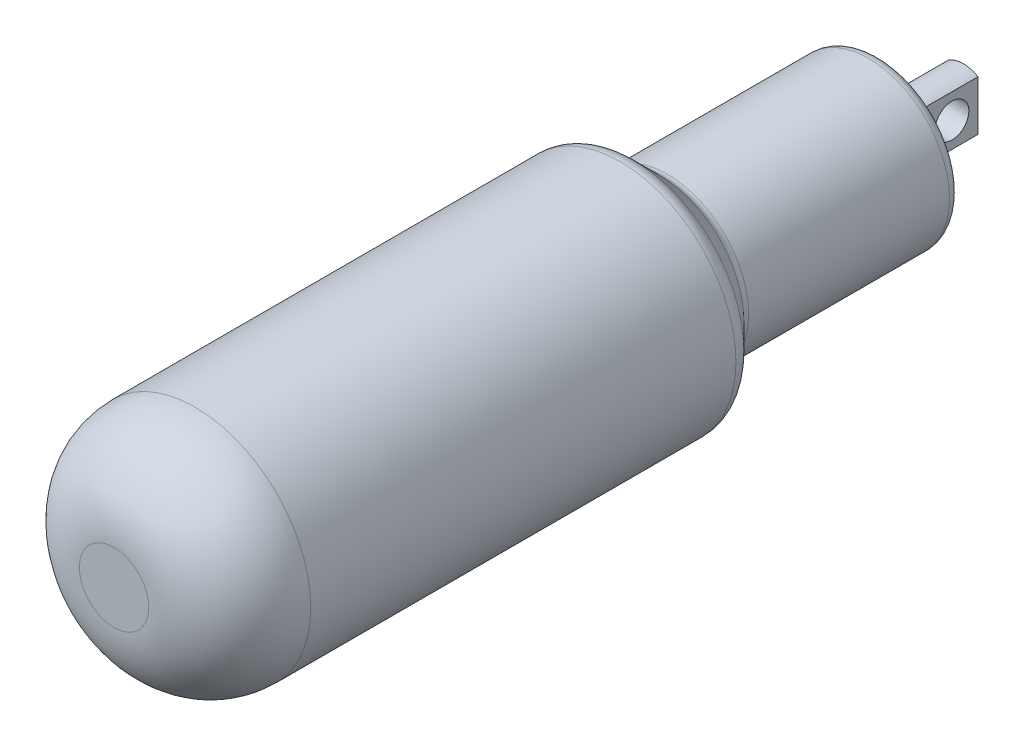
ISO-10303-21;
HEADER;
FILE_DESCRIPTION(('STEP AP214'),'2;1');
FILE_NAME('part.step','',(''),(''),'','','');
FILE_SCHEMA(('AUTOMOTIVE_DESIGN { 1 0 10303 214 1 1 1 1 }'));
ENDSEC;
DATA;
#1=APPLICATION_CONTEXT('core data for automotive mechanical design processes');
#2=APPLICATION_PROTOCOL_DEFINITION('international standard','automotive_design',2000,#1);
#3=PRODUCT_CONTEXT('',#1,'mechanical');
#4=PRODUCT('Part','Part','',(#3));
#5=PRODUCT_RELATED_PRODUCT_CATEGORY('part','',(#4));
#6=PRODUCT_DEFINITION_FORMATION('','',#4);
#7=PRODUCT_DEFINITION_CONTEXT('part definition',#1,'design');
#8=PRODUCT_DEFINITION('design','',#6,#7);
#9=PRODUCT_DEFINITION_SHAPE('','',#8);
#10=(LENGTH_UNIT() NAMED_UNIT(*) SI_UNIT(.MILLI.,.METRE.));
#11=(NAMED_UNIT(*) PLANE_ANGLE_UNIT() SI_UNIT($,.RADIAN.));
#12=(NAMED_UNIT(*) SI_UNIT($,.STERADIAN.) SOLID_ANGLE_UNIT());
#13=UNCERTAINTY_MEASURE_WITH_UNIT(LENGTH_MEASURE(1.E-05),#10,'distance_accuracy_value','');
#14=(GEOMETRIC_REPRESENTATION_CONTEXT(3) GLOBAL_UNCERTAINTY_ASSIGNED_CONTEXT((#13)) GLOBAL_UNIT_ASSIGNED_CONTEXT((#10,
#11,#12)) REPRESENTATION_CONTEXT('',''));
#15=CARTESIAN_POINT('',(0.,0.,0.));
#16=DIRECTION('',(0.,0.,1.));
#17=DIRECTION('',(1.,0.,0.));
#18=AXIS2_PLACEMENT_3D('',#15,#16,#17);
#19=CARTESIAN_POINT('',(0.,0.,-2.6999946));
#20=DIRECTION('',(0.,0.,1.));
#21=DIRECTION('',(1.,0.,0.));
#22=AXIS2_PLACEMENT_3D('',#19,#20,#21);
#23=CYLINDRICAL_SURFACE('',#22,2.99999997);
#24=CARTESIAN_POINT('',(0.,0.,5.9400054));
#25=DIRECTION('',(0.,0.,1.));
#26=DIRECTION('',(1.,0.,0.));
#27=AXIS2_PLACEMENT_3D('',#24,#25,#26);
#28=CIRCLE('',#27,2.99999997);
#29=CARTESIAN_POINT('',(2.99999997,0.,5.9400054));
#30=VERTEX_POINT('',#29);
#31=EDGE_CURVE('E99',#30,#30,#28,.T.);
#32=ORIENTED_EDGE('',*,*,#31,.F.);
#33=EDGE_LOOP('',(#32));
#34=FACE_BOUND('',#33,.T.);
#35=DIRECTION('',(0.,0.,1.));
#36=VECTOR('',#35,1.);
#37=CARTESIAN_POINT('',(-1.51574815,-2.5889201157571,-2.6999946));
#38=LINE('',#37,#36);
#39=CARTESIAN_POINT('',(-1.51574815,-2.5889201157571,-2.6999946));
#40=VERTEX_POINT('',#39);
#41=CARTESIAN_POINT('',(-1.51574815,-2.5889201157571,2.700003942));
#42=VERTEX_POINT('',#41);
#43=EDGE_CURVE('E105',#40,#42,#38,.T.);
#44=ORIENTED_EDGE('',*,*,#43,.F.);
#45=CARTESIAN_POINT('',(0.,0.,-2.6999946));
#46=DIRECTION('',(0.,0.,1.));
#47=DIRECTION('',(1.,0.,0.));
#48=AXIS2_PLACEMENT_3D('',#45,#46,#47);
#49=CIRCLE('',#48,2.99999997);
#50=CARTESIAN_POINT('',(1.51574815,-2.5889201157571,-2.6999946));
#51=VERTEX_POINT('',#50);
#52=EDGE_CURVE('E104',#40,#51,#49,.T.);
#53=ORIENTED_EDGE('',*,*,#52,.T.);
#54=DIRECTION('',(0.,0.,1.));
#55=VECTOR('',#54,1.);
#56=CARTESIAN_POINT('',(1.51574815,-2.5889201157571,-2.6999946));
#57=LINE('',#56,#55);
#58=CARTESIAN_POINT('',(1.51574815,-2.5889201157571,2.700003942));
#59=VERTEX_POINT('',#58);
#60=EDGE_CURVE('E29',#59,#51,#57,.F.);
#61=ORIENTED_EDGE('',*,*,#60,.F.);
#62=CARTESIAN_POINT('',(0.,0.,2.700003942));
#63=DIRECTION('',(0.,0.,-1.));
#64=DIRECTION('',(-1.,0.,0.));
#65=AXIS2_PLACEMENT_3D('',#62,#63,#64);
#66=CIRCLE('',#65,2.99999997);
#67=CARTESIAN_POINT('',(1.51574815,2.58892011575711,2.700003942));
#68=VERTEX_POINT('',#67);
#69=EDGE_CURVE('E22',#68,#59,#66,.T.);
#70=ORIENTED_EDGE('',*,*,#69,.F.);
#71=DIRECTION('',(0.,0.,1.));
#72=VECTOR('',#71,1.);
#73=CARTESIAN_POINT('',(1.51574815,2.58892011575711,-2.6999946));
#74=LINE('',#73,#72);
#75=CARTESIAN_POINT('',(1.51574815,2.58892011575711,-2.6999946));
#76=VERTEX_POINT('',#75);
#77=EDGE_CURVE('E54',#76,#68,#74,.T.);
#78=ORIENTED_EDGE('',*,*,#77,.F.);
#79=CARTESIAN_POINT('',(-1.51574815,2.58892011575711,-2.6999946));
#80=VERTEX_POINT('',#79);
#81=EDGE_CURVE('E102',#76,#80,#49,.T.);
#82=ORIENTED_EDGE('',*,*,#81,.T.);
#83=DIRECTION('',(0.,0.,1.));
#84=VECTOR('',#83,1.);
#85=CARTESIAN_POINT('',(-1.51574815,2.58892011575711,-2.6999946));
#86=LINE('',#85,#84);
#87=CARTESIAN_POINT('',(-1.51574815,2.58892011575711,2.700003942));
#88=VERTEX_POINT('',#87);
#89=EDGE_CURVE('E37',#88,#80,#86,.F.);
#90=ORIENTED_EDGE('',*,*,#89,.F.);
#91=CARTESIAN_POINT('',(0.,0.,2.700003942));
#92=DIRECTION('',(0.,0.,-1.));
#93=DIRECTION('',(-1.,0.,0.));
#94=AXIS2_PLACEMENT_3D('',#91,#92,#93);
#95=CIRCLE('',#94,2.99999997);
#96=EDGE_CURVE('E9',#42,#88,#95,.T.);
#97=ORIENTED_EDGE('',*,*,#96,.F.);
#98=EDGE_LOOP('',(#44,#53,#61,#70,#78,#82,#90,#97));
#99=FACE_BOUND('',#98,.T.);
#100=ADVANCED_FACE('F14',(#34,#99),#23,.T.);
#101=CARTESIAN_POINT('',(0.,2.99999997,-2.6999946));
#102=DIRECTION('',(0.,0.,1.));
#103=DIRECTION('',(1.,0.,0.));
#104=AXIS2_PLACEMENT_3D('',#101,#102,#103);
#105=PLANE('',#104);
#106=DIRECTION('',(0.,-1.,0.));
#107=VECTOR('',#106,1.);
#108=CARTESIAN_POINT('',(-1.51574815,2.99999997,-2.6999946));
#109=LINE('',#108,#107);
#110=EDGE_CURVE('E71',#80,#40,#109,.T.);
#111=ORIENTED_EDGE('',*,*,#110,.F.);
#112=ORIENTED_EDGE('',*,*,#81,.F.);
#113=DIRECTION('',(0.,1.,0.));
#114=VECTOR('',#113,1.);
#115=CARTESIAN_POINT('',(1.51574815,2.99999997,-2.6999946));
#116=LINE('',#115,#114);
#117=EDGE_CURVE('E58',#51,#76,#116,.T.);
#118=ORIENTED_EDGE('',*,*,#117,.F.);
#119=ORIENTED_EDGE('',*,*,#52,.F.);
#120=EDGE_LOOP('',(#111,#112,#118,#119));
#121=FACE_BOUND('',#120,.T.);
#122=ADVANCED_FACE('F127',(#121),#105,.F.);
#123=CARTESIAN_POINT('',(0.,0.,85.400002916));
#124=DIRECTION('',(0.,0.,-1.));
#125=DIRECTION('',(-1.,0.,0.));
#126=AXIS2_PLACEMENT_3D('',#123,#124,#125);
#127=PLANE('',#126);
#128=CARTESIAN_POINT('',(0.,0.,85.400002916));
#129=DIRECTION('',(0.,0.,1.));
#130=DIRECTION('',(1.,0.,0.));
#131=AXIS2_PLACEMENT_3D('',#128,#129,#130);
#132=CIRCLE('',#131,3.600000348);
#133=CARTESIAN_POINT('',(3.600000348,0.,85.400002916));
#134=VERTEX_POINT('',#133);
#135=EDGE_CURVE('E75',#134,#134,#132,.T.);
#136=ORIENTED_EDGE('',*,*,#135,.T.);
#137=EDGE_LOOP('',(#136));
#138=FACE_BOUND('',#137,.T.);
#139=ADVANCED_FACE('F16',(#138),#127,.F.);
#140=CARTESIAN_POINT('',(0.,0.,77.000003));
#141=DIRECTION('',(0.,0.,1.));
#142=DIRECTION('',(1.,0.,0.));
#143=AXIS2_PLACEMENT_3D('',#140,#141,#142);
#144=DEGENERATE_TOROIDAL_SURFACE('',#143,3.6000003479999,8.3999999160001,.T.);
#145=ORIENTED_EDGE('',*,*,#135,.F.);
#146=EDGE_LOOP('',(#145));
#147=FACE_BOUND('',#146,.T.);
#148=CARTESIAN_POINT('',(0.,0.,77.000003));
#149=DIRECTION('',(0.,0.,1.));
#150=DIRECTION('',(1.,0.,0.));
#151=AXIS2_PLACEMENT_3D('',#148,#149,#150);
#152=CIRCLE('',#151,12.000000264);
#153=CARTESIAN_POINT('',(12.000000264,0.,77.000003));
#154=VERTEX_POINT('',#153);
#155=EDGE_CURVE('E78',#154,#154,#152,.T.);
#156=ORIENTED_EDGE('',*,*,#155,.T.);
#157=EDGE_LOOP('',(#156));
#158=FACE_BOUND('',#157,.T.);
#159=ADVANCED_FACE('F136',(#147,#158),#144,.T.);
#160=CARTESIAN_POINT('',(0.,0.,-2.6999946));
#161=DIRECTION('',(0.,0.,1.));
#162=DIRECTION('',(1.,0.,0.));
#163=AXIS2_PLACEMENT_3D('',#160,#161,#162);
#164=CYLINDRICAL_SURFACE('',#163,12.000000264);
#165=ORIENTED_EDGE('',*,*,#155,.F.);
#166=EDGE_LOOP('',(#165));
#167=FACE_BOUND('',#166,.T.);
#168=CARTESIAN_POINT('',(0.,0.,32.895096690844));
#169=DIRECTION('',(0.,0.,1.));
#170=DIRECTION('',(1.,0.,0.));
#171=AXIS2_PLACEMENT_3D('',#168,#169,#170);
#172=CIRCLE('',#171,12.000000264);
#173=CARTESIAN_POINT('',(12.000000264,0.,32.895096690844));
#174=VERTEX_POINT('',#173);
#175=EDGE_CURVE('E81',#174,#174,#172,.T.);
#176=ORIENTED_EDGE('',*,*,#175,.T.);
#177=EDGE_LOOP('',(#176));
#178=FACE_BOUND('',#177,.T.);
#179=ADVANCED_FACE('F165',(#167,#178),#164,.T.);
#180=CARTESIAN_POINT('',(0.,0.,32.8950966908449));
#181=DIRECTION('',(0.,0.,1.));
#182=DIRECTION('',(1.,0.,0.));
#183=AXIS2_PLACEMENT_3D('',#180,#181,#182);
#184=TOROIDAL_SURFACE('',#183,10.0000003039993,1.99999996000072);
#185=ORIENTED_EDGE('',*,*,#175,.F.);
#186=EDGE_LOOP('',(#185));
#187=FACE_BOUND('',#186,.T.);
#188=CARTESIAN_POINT('',(0.,0.,31.480883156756));
#189=DIRECTION('',(0.,0.,1.));
#190=DIRECTION('',(1.,0.,0.));
#191=AXIS2_PLACEMENT_3D('',#188,#189,#190);
#192=CIRCLE('',#191,11.414213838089);
#193=CARTESIAN_POINT('',(11.414213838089,0.,31.480883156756));
#194=VERTEX_POINT('',#193);
#195=EDGE_CURVE('E84',#194,#194,#192,.T.);
#196=ORIENTED_EDGE('',*,*,#195,.T.);
#197=EDGE_LOOP('',(#196));
#198=FACE_BOUND('',#197,.T.);
#199=ADVANCED_FACE('F161',(#187,#198),#184,.T.);
#200=CARTESIAN_POINT('',(0.,0.,28.818141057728));
#201=DIRECTION('',(0.,0.,1.));
#202=DIRECTION('',(1.,0.,0.));
#203=AXIS2_PLACEMENT_3D('',#200,#201,#202);
#204=CONICAL_SURFACE('',#203,8.751471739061,0.785398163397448);
#205=ORIENTED_EDGE('',*,*,#195,.F.);
#206=EDGE_LOOP('',(#205));
#207=FACE_BOUND('',#206,.T.);
#208=CARTESIAN_POINT('',(0.,0.,28.818141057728));
#209=DIRECTION('',(0.,0.,1.));
#210=DIRECTION('',(1.,0.,0.));
#211=AXIS2_PLACEMENT_3D('',#208,#209,#210);
#212=CIRCLE('',#211,8.751471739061);
#213=CARTESIAN_POINT('',(8.751471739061,0.,28.818141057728));
#214=VERTEX_POINT('',#213);
#215=EDGE_CURVE('E87',#214,#214,#212,.T.);
#216=ORIENTED_EDGE('',*,*,#215,.T.);
#217=EDGE_LOOP('',(#216));
#218=FACE_BOUND('',#217,.T.);
#219=ADVANCED_FACE('F157',(#207,#218),#204,.T.);
#220=CARTESIAN_POINT('',(0.,0.,27.9696129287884));
#221=DIRECTION('',(0.,0.,1.));
#222=DIRECTION('',(1.,0.,0.));
#223=AXIS2_PLACEMENT_3D('',#220,#221,#222);
#224=TOROIDAL_SURFACE('',#223,9.59999986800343,1.19999998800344);
#225=ORIENTED_EDGE('',*,*,#215,.F.);
#226=EDGE_LOOP('',(#225));
#227=FACE_BOUND('',#226,.T.);
#228=CARTESIAN_POINT('',(0.,0.,27.96961292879));
#229=DIRECTION('',(0.,0.,1.));
#230=DIRECTION('',(1.,0.,0.));
#231=AXIS2_PLACEMENT_3D('',#228,#229,#230);
#232=CIRCLE('',#231,8.39999988);
#233=CARTESIAN_POINT('',(8.39999988,0.,27.96961292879));
#234=VERTEX_POINT('',#233);
#235=EDGE_CURVE('E90',#234,#234,#232,.T.);
#236=ORIENTED_EDGE('',*,*,#235,.T.);
#237=EDGE_LOOP('',(#236));
#238=FACE_BOUND('',#237,.T.);
#239=ADVANCED_FACE('F153',(#227,#238),#224,.F.);
#240=CARTESIAN_POINT('',(0.,0.,-2.6999946));
#241=DIRECTION('',(0.,0.,1.));
#242=DIRECTION('',(1.,0.,0.));
#243=AXIS2_PLACEMENT_3D('',#240,#241,#242);
#244=CYLINDRICAL_SURFACE('',#243,8.39999988);
#245=ORIENTED_EDGE('',*,*,#235,.F.);
#246=EDGE_LOOP('',(#245));
#247=FACE_BOUND('',#246,.T.);
#248=CARTESIAN_POINT('',(0.,0.,7.14000538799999));
#249=DIRECTION('',(0.,0.,1.));
#250=DIRECTION('',(1.,0.,0.));
#251=AXIS2_PLACEMENT_3D('',#248,#249,#250);
#252=CIRCLE('',#251,8.39999988);
#253=CARTESIAN_POINT('',(8.39999988,0.,7.14000538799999));
#254=VERTEX_POINT('',#253);
#255=EDGE_CURVE('E93',#254,#254,#252,.T.);
#256=ORIENTED_EDGE('',*,*,#255,.T.);
#257=EDGE_LOOP('',(#256));
#258=FACE_BOUND('',#257,.T.);
#259=ADVANCED_FACE('F149',(#247,#258),#244,.T.);
#260=CARTESIAN_POINT('',(0.,0.,7.14000538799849));
#261=DIRECTION('',(0.,0.,1.));
#262=DIRECTION('',(1.,0.,0.));
#263=AXIS2_PLACEMENT_3D('',#260,#261,#262);
#264=TOROIDAL_SURFACE('',#263,7.19999989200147,1.19999998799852);
#265=ORIENTED_EDGE('',*,*,#255,.F.);
#266=EDGE_LOOP('',(#265));
#267=FACE_BOUND('',#266,.T.);
#268=CARTESIAN_POINT('',(0.,0.,5.9400054));
#269=DIRECTION('',(0.,0.,1.));
#270=DIRECTION('',(1.,0.,0.));
#271=AXIS2_PLACEMENT_3D('',#268,#269,#270);
#272=CIRCLE('',#271,7.199999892);
#273=CARTESIAN_POINT('',(7.199999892,0.,5.9400054));
#274=VERTEX_POINT('',#273);
#275=EDGE_CURVE('E96',#274,#274,#272,.T.);
#276=ORIENTED_EDGE('',*,*,#275,.T.);
#277=EDGE_LOOP('',(#276));
#278=FACE_BOUND('',#277,.T.);
#279=ADVANCED_FACE('F145',(#267,#278),#264,.T.);
#280=CARTESIAN_POINT('',(0.,7.199999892,5.9400054));
#281=DIRECTION('',(0.,0.,1.));
#282=DIRECTION('',(1.,0.,0.));
#283=AXIS2_PLACEMENT_3D('',#280,#281,#282);
#284=PLANE('',#283);
#285=ORIENTED_EDGE('',*,*,#275,.F.);
#286=EDGE_LOOP('',(#285));
#287=FACE_BOUND('',#286,.T.);
#288=ORIENTED_EDGE('',*,*,#31,.T.);
#289=EDGE_LOOP('',(#288));
#290=FACE_BOUND('',#289,.T.);
#291=ADVANCED_FACE('F142',(#287,#290),#284,.F.);
#292=CARTESIAN_POINT('',(1.51574815,35.,-4.891996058));
#293=DIRECTION('',(1.,0.,0.));
#294=DIRECTION('',(0.,1.,0.));
#295=AXIS2_PLACEMENT_3D('',#292,#293,#294);
#296=PLANE('',#295);
#297=CARTESIAN_POINT('',(1.51574815,0.,0.));
#298=DIRECTION('',(1.,0.,0.));
#299=DIRECTION('',(0.,1.,0.));
#300=AXIS2_PLACEMENT_3D('',#297,#298,#299);
#301=CIRCLE('',#300,1.75);
#302=CARTESIAN_POINT('',(1.51574815,1.75,0.));
#303=VERTEX_POINT('',#302);
#304=EDGE_CURVE('E67',#303,#303,#301,.T.);
#305=ORIENTED_EDGE('',*,*,#304,.F.);
#306=EDGE_LOOP('',(#305));
#307=FACE_BOUND('',#306,.T.);
#308=ORIENTED_EDGE('',*,*,#77,.T.);
#309=DIRECTION('',(0.,-1.,0.));
#310=VECTOR('',#309,1.);
#311=CARTESIAN_POINT('',(1.51574815,35.,2.700003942));
#312=LINE('',#311,#310);
#313=EDGE_CURVE('E57',#68,#59,#312,.T.);
#314=ORIENTED_EDGE('',*,*,#313,.T.);
#315=ORIENTED_EDGE('',*,*,#60,.T.);
#316=ORIENTED_EDGE('',*,*,#117,.T.);
#317=EDGE_LOOP('',(#308,#314,#315,#316));
#318=FACE_BOUND('',#317,.T.);
#319=ADVANCED_FACE('F56',(#307,#318),#296,.T.);
#320=CARTESIAN_POINT('',(1.51574815,35.,2.700003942));
#321=DIRECTION('',(0.,0.,-1.));
#322=DIRECTION('',(-1.,0.,0.));
#323=AXIS2_PLACEMENT_3D('',#320,#321,#322);
#324=PLANE('',#323);
#325=ORIENTED_EDGE('',*,*,#69,.T.);
#326=ORIENTED_EDGE('',*,*,#313,.F.);
#327=EDGE_LOOP('',(#325,#326));
#328=FACE_BOUND('',#327,.T.);
#329=ADVANCED_FACE('F65',(#328),#324,.T.);
#330=CARTESIAN_POINT('',(-4.05574815,35.,2.700003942));
#331=DIRECTION('',(0.,0.,-1.));
#332=DIRECTION('',(-1.,0.,0.));
#333=AXIS2_PLACEMENT_3D('',#330,#331,#332);
#334=PLANE('',#333);
#335=ORIENTED_EDGE('',*,*,#96,.T.);
#336=DIRECTION('',(0.,-1.,0.));
#337=VECTOR('',#336,1.);
#338=CARTESIAN_POINT('',(-1.51574815,35.,2.700003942));
#339=LINE('',#338,#337);
#340=EDGE_CURVE('E66',#88,#42,#339,.T.);
#341=ORIENTED_EDGE('',*,*,#340,.T.);
#342=EDGE_LOOP('',(#335,#341));
#343=FACE_BOUND('',#342,.T.);
#344=ADVANCED_FACE('F121',(#343),#334,.T.);
#345=CARTESIAN_POINT('',(-1.51574815,35.,2.700003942));
#346=DIRECTION('',(-1.,0.,0.));
#347=DIRECTION('',(0.,-1.,0.));
#348=AXIS2_PLACEMENT_3D('',#345,#346,#347);
#349=PLANE('',#348);
#350=CARTESIAN_POINT('',(-1.51574815,0.,0.));
#351=DIRECTION('',(-1.,0.,0.));
#352=DIRECTION('',(0.,-1.,0.));
#353=AXIS2_PLACEMENT_3D('',#350,#351,#352);
#354=CIRCLE('',#353,1.75);
#355=CARTESIAN_POINT('',(-1.51574815,-1.75,0.));
#356=VERTEX_POINT('',#355);
#357=EDGE_CURVE('E113',#356,#356,#354,.T.);
#358=ORIENTED_EDGE('',*,*,#357,.F.);
#359=EDGE_LOOP('',(#358));
#360=FACE_BOUND('',#359,.T.);
#361=ORIENTED_EDGE('',*,*,#43,.T.);
#362=ORIENTED_EDGE('',*,*,#340,.F.);
#363=ORIENTED_EDGE('',*,*,#89,.T.);
#364=ORIENTED_EDGE('',*,*,#110,.T.);
#365=EDGE_LOOP('',(#361,#362,#363,#364));
#366=FACE_BOUND('',#365,.T.);
#367=ADVANCED_FACE('F119',(#360,#366),#349,.T.);
#368=CARTESIAN_POINT('',(8.48425185,0.,0.));
#369=DIRECTION('',(-1.,0.,0.));
#370=DIRECTION('',(0.,-1.,0.));
#371=AXIS2_PLACEMENT_3D('',#368,#369,#370);
#372=CYLINDRICAL_SURFACE('',#371,1.75);
#373=ORIENTED_EDGE('',*,*,#304,.T.);
#374=EDGE_LOOP('',(#373));
#375=FACE_BOUND('',#374,.T.);
#376=ORIENTED_EDGE('',*,*,#357,.T.);
#377=EDGE_LOOP('',(#376));
#378=FACE_BOUND('',#377,.T.);
#379=ADVANCED_FACE('F117',(#375,#378),#372,.F.);
#380=CLOSED_SHELL('',(#100,#122,#139,#159,#179,#199,#219,#239,#259,#279,#291,#319,#329,#344,
#367,#379));
#381=MANIFOLD_SOLID_BREP('B1',#380);
#382=ADVANCED_BREP_SHAPE_REPRESENTATION('',(#18,#381),#14);
#383=SHAPE_DEFINITION_REPRESENTATION(#9,#382);
ENDSEC;
END-ISO-10303-21;
